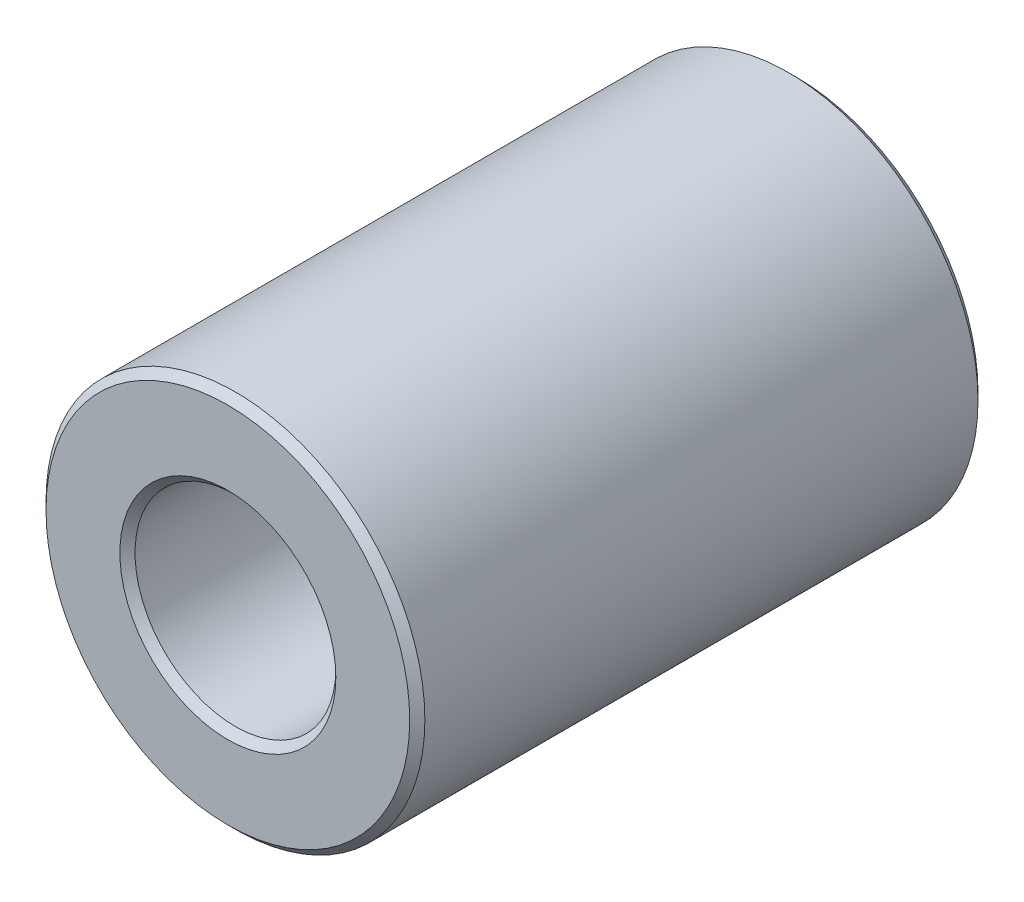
ISO-10303-21;
HEADER;
FILE_DESCRIPTION(('STEP AP214'),'2;1');
FILE_NAME('part.step','',(''),(''),'','','');
FILE_SCHEMA(('AUTOMOTIVE_DESIGN { 1 0 10303 214 1 1 1 1 }'));
ENDSEC;
DATA;
#1=APPLICATION_CONTEXT('core data for automotive mechanical design processes');
#2=APPLICATION_PROTOCOL_DEFINITION('international standard','automotive_design',2000,#1);
#3=PRODUCT_CONTEXT('',#1,'mechanical');
#4=PRODUCT('Part','Part','',(#3));
#5=PRODUCT_RELATED_PRODUCT_CATEGORY('part','',(#4));
#6=PRODUCT_DEFINITION_FORMATION('','',#4);
#7=PRODUCT_DEFINITION_CONTEXT('part definition',#1,'design');
#8=PRODUCT_DEFINITION('design','',#6,#7);
#9=PRODUCT_DEFINITION_SHAPE('','',#8);
#10=(LENGTH_UNIT() NAMED_UNIT(*) SI_UNIT(.MILLI.,.METRE.));
#11=(NAMED_UNIT(*) PLANE_ANGLE_UNIT() SI_UNIT($,.RADIAN.));
#12=(NAMED_UNIT(*) SI_UNIT($,.STERADIAN.) SOLID_ANGLE_UNIT());
#13=UNCERTAINTY_MEASURE_WITH_UNIT(LENGTH_MEASURE(1.E-05),#10,'distance_accuracy_value','');
#14=(GEOMETRIC_REPRESENTATION_CONTEXT(3) GLOBAL_UNCERTAINTY_ASSIGNED_CONTEXT((#13)) GLOBAL_UNIT_ASSIGNED_CONTEXT((#10,
#11,#12)) REPRESENTATION_CONTEXT('',''));
#15=CARTESIAN_POINT('',(0.,0.,0.));
#16=DIRECTION('',(0.,0.,1.));
#17=DIRECTION('',(1.,0.,0.));
#18=AXIS2_PLACEMENT_3D('',#15,#16,#17);
#19=CARTESIAN_POINT('',(0.,0.,7.5));
#20=DIRECTION('',(0.,0.,1.));
#21=DIRECTION('',(1.,0.,0.));
#22=AXIS2_PLACEMENT_3D('',#19,#20,#21);
#23=PLANE('',#22);
#24=CARTESIAN_POINT('',(0.,0.,7.5));
#25=DIRECTION('',(0.,0.,1.));
#26=DIRECTION('',(1.,0.,0.));
#27=AXIS2_PLACEMENT_3D('',#24,#25,#26);
#28=CIRCLE('',#27,2.85);
#29=CARTESIAN_POINT('',(2.85,0.,7.5));
#30=VERTEX_POINT('',#29);
#31=EDGE_CURVE('E10',#30,#30,#28,.F.);
#32=ORIENTED_EDGE('',*,*,#31,.T.);
#33=EDGE_LOOP('',(#32));
#34=FACE_BOUND('',#33,.T.);
#35=CARTESIAN_POINT('',(0.,0.,7.5));
#36=DIRECTION('',(0.,0.,1.));
#37=DIRECTION('',(1.,0.,0.));
#38=AXIS2_PLACEMENT_3D('',#35,#36,#37);
#39=CIRCLE('',#38,4.8);
#40=CARTESIAN_POINT('',(-4.8,0.,7.5));
#41=VERTEX_POINT('',#40);
#42=EDGE_CURVE('E45',#41,#41,#39,.T.);
#43=ORIENTED_EDGE('',*,*,#42,.T.);
#44=EDGE_LOOP('',(#43));
#45=FACE_BOUND('',#44,.T.);
#46=ADVANCED_FACE('F37',(#34,#45),#23,.T.);
#47=CARTESIAN_POINT('',(0.,0.,-7.5));
#48=DIRECTION('',(0.,0.,1.));
#49=DIRECTION('',(1.,0.,0.));
#50=AXIS2_PLACEMENT_3D('',#47,#48,#49);
#51=PLANE('',#50);
#52=CARTESIAN_POINT('',(0.,0.,-7.5));
#53=DIRECTION('',(0.,0.,1.));
#54=DIRECTION('',(1.,0.,0.));
#55=AXIS2_PLACEMENT_3D('',#52,#53,#54);
#56=CIRCLE('',#55,4.8);
#57=CARTESIAN_POINT('',(4.8,0.,-7.5));
#58=VERTEX_POINT('',#57);
#59=EDGE_CURVE('E62',#58,#58,#56,.F.);
#60=ORIENTED_EDGE('',*,*,#59,.T.);
#61=EDGE_LOOP('',(#60));
#62=FACE_BOUND('',#61,.T.);
#63=CARTESIAN_POINT('',(0.,0.,-7.5));
#64=DIRECTION('',(0.,0.,1.));
#65=DIRECTION('',(1.,0.,0.));
#66=AXIS2_PLACEMENT_3D('',#63,#64,#65);
#67=CIRCLE('',#66,2.85);
#68=CARTESIAN_POINT('',(2.85,0.,-7.5));
#69=VERTEX_POINT('',#68);
#70=EDGE_CURVE('E66',#69,#69,#67,.T.);
#71=ORIENTED_EDGE('',*,*,#70,.T.);
#72=EDGE_LOOP('',(#71));
#73=FACE_BOUND('',#72,.T.);
#74=ADVANCED_FACE('F89',(#62,#73),#51,.F.);
#75=CARTESIAN_POINT('',(0.,0.,7.5));
#76=DIRECTION('',(0.,0.,-1.));
#77=DIRECTION('',(-1.,0.,0.));
#78=AXIS2_PLACEMENT_3D('',#75,#76,#77);
#79=CYLINDRICAL_SURFACE('',#78,5.);
#80=CARTESIAN_POINT('',(0.,0.,-7.3));
#81=DIRECTION('',(0.,0.,1.));
#82=DIRECTION('',(1.,0.,0.));
#83=AXIS2_PLACEMENT_3D('',#80,#81,#82);
#84=CIRCLE('',#83,5.);
#85=CARTESIAN_POINT('',(5.,0.,-7.3));
#86=VERTEX_POINT('',#85);
#87=EDGE_CURVE('E70',#86,#86,#84,.T.);
#88=ORIENTED_EDGE('',*,*,#87,.T.);
#89=EDGE_LOOP('',(#88));
#90=FACE_BOUND('',#89,.T.);
#91=CARTESIAN_POINT('',(0.,0.,7.3));
#92=DIRECTION('',(0.,0.,1.));
#93=DIRECTION('',(1.,0.,0.));
#94=AXIS2_PLACEMENT_3D('',#91,#92,#93);
#95=CIRCLE('',#94,5.);
#96=CARTESIAN_POINT('',(-5.,0.,7.3));
#97=VERTEX_POINT('',#96);
#98=EDGE_CURVE('E73',#97,#97,#95,.F.);
#99=ORIENTED_EDGE('',*,*,#98,.T.);
#100=EDGE_LOOP('',(#99));
#101=FACE_BOUND('',#100,.T.);
#102=ADVANCED_FACE('F78',(#90,#101),#79,.T.);
#103=CARTESIAN_POINT('',(0.,0.,7.5));
#104=DIRECTION('',(0.,0.,-1.));
#105=DIRECTION('',(-1.,0.,0.));
#106=AXIS2_PLACEMENT_3D('',#103,#104,#105);
#107=CYLINDRICAL_SURFACE('',#106,2.65);
#108=CARTESIAN_POINT('',(0.,0.,-7.3));
#109=DIRECTION('',(0.,0.,1.));
#110=DIRECTION('',(1.,0.,0.));
#111=AXIS2_PLACEMENT_3D('',#108,#109,#110);
#112=CIRCLE('',#111,2.65);
#113=CARTESIAN_POINT('',(2.65,0.,-7.3));
#114=VERTEX_POINT('',#113);
#115=EDGE_CURVE('E51',#114,#114,#112,.F.);
#116=ORIENTED_EDGE('',*,*,#115,.T.);
#117=EDGE_LOOP('',(#116));
#118=FACE_BOUND('',#117,.T.);
#119=CARTESIAN_POINT('',(0.,0.,7.3));
#120=DIRECTION('',(0.,0.,1.));
#121=DIRECTION('',(1.,0.,0.));
#122=AXIS2_PLACEMENT_3D('',#119,#120,#121);
#123=CIRCLE('',#122,2.65);
#124=CARTESIAN_POINT('',(2.65,0.,7.3));
#125=VERTEX_POINT('',#124);
#126=EDGE_CURVE('E56',#125,#125,#123,.T.);
#127=ORIENTED_EDGE('',*,*,#126,.T.);
#128=EDGE_LOOP('',(#127));
#129=FACE_BOUND('',#128,.T.);
#130=ADVANCED_FACE('F97',(#118,#129),#107,.F.);
#131=CARTESIAN_POINT('',(0.,0.,-7.3));
#132=DIRECTION('',(0.,0.,1.));
#133=DIRECTION('',(1.,0.,0.));
#134=AXIS2_PLACEMENT_3D('',#131,#132,#133);
#135=CONICAL_SURFACE('',#134,5.,0.785398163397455);
#136=ORIENTED_EDGE('',*,*,#59,.F.);
#137=EDGE_LOOP('',(#136));
#138=FACE_BOUND('',#137,.T.);
#139=ORIENTED_EDGE('',*,*,#87,.F.);
#140=EDGE_LOOP('',(#139));
#141=FACE_BOUND('',#140,.T.);
#142=ADVANCED_FACE('F102',(#138,#141),#135,.T.);
#143=CARTESIAN_POINT('',(0.,0.,-7.5));
#144=DIRECTION('',(0.,0.,-1.));
#145=DIRECTION('',(-1.,0.,0.));
#146=AXIS2_PLACEMENT_3D('',#143,#144,#145);
#147=CONICAL_SURFACE('',#146,2.85,0.785398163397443);
#148=ORIENTED_EDGE('',*,*,#115,.F.);
#149=EDGE_LOOP('',(#148));
#150=FACE_BOUND('',#149,.T.);
#151=ORIENTED_EDGE('',*,*,#70,.F.);
#152=EDGE_LOOP('',(#151));
#153=FACE_BOUND('',#152,.T.);
#154=ADVANCED_FACE('F86',(#150,#153),#147,.F.);
#155=CARTESIAN_POINT('',(0.,0.,7.3));
#156=DIRECTION('',(0.,0.,1.));
#157=DIRECTION('',(1.,0.,0.));
#158=AXIS2_PLACEMENT_3D('',#155,#156,#157);
#159=CONICAL_SURFACE('',#158,2.65,0.785398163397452);
#160=ORIENTED_EDGE('',*,*,#31,.F.);
#161=EDGE_LOOP('',(#160));
#162=FACE_BOUND('',#161,.T.);
#163=ORIENTED_EDGE('',*,*,#126,.F.);
#164=EDGE_LOOP('',(#163));
#165=FACE_BOUND('',#164,.T.);
#166=ADVANCED_FACE('F82',(#162,#165),#159,.F.);
#167=CARTESIAN_POINT('',(0.,0.,7.5));
#168=DIRECTION('',(0.,0.,-1.));
#169=DIRECTION('',(-1.,0.,0.));
#170=AXIS2_PLACEMENT_3D('',#167,#168,#169);
#171=CONICAL_SURFACE('',#170,4.8,0.785398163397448);
#172=CARTESIAN_POINT('',(-5.,0.,7.3));
#173=CARTESIAN_POINT('',(-4.99791666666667,0.,7.30208333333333));
#174=CARTESIAN_POINT('',(-4.99583333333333,0.,7.30416666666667));
#175=CARTESIAN_POINT('',(-4.99166666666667,0.,7.30833333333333));
#176=CARTESIAN_POINT('',(-4.98958333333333,0.,7.31041666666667));
#177=CARTESIAN_POINT('',(-4.98541666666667,0.,7.31458333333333));
#178=CARTESIAN_POINT('',(-4.98333333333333,0.,7.31666666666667));
#179=CARTESIAN_POINT('',(-4.97916666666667,0.,7.32083333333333));
#180=CARTESIAN_POINT('',(-4.97708333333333,0.,7.32291666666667));
#181=CARTESIAN_POINT('',(-4.97291666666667,0.,7.32708333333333));
#182=CARTESIAN_POINT('',(-4.97083333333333,0.,7.32916666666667));
#183=CARTESIAN_POINT('',(-4.96666666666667,0.,7.33333333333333));
#184=CARTESIAN_POINT('',(-4.96458333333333,0.,7.33541666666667));
#185=CARTESIAN_POINT('',(-4.96041666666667,0.,7.33958333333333));
#186=CARTESIAN_POINT('',(-4.95833333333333,0.,7.34166666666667));
#187=CARTESIAN_POINT('',(-4.95416666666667,0.,7.34583333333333));
#188=CARTESIAN_POINT('',(-4.95208333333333,0.,7.34791666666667));
#189=CARTESIAN_POINT('',(-4.94791666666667,0.,7.35208333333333));
#190=CARTESIAN_POINT('',(-4.94583333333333,0.,7.35416666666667));
#191=CARTESIAN_POINT('',(-4.94166666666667,0.,7.35833333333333));
#192=CARTESIAN_POINT('',(-4.93958333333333,0.,7.36041666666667));
#193=CARTESIAN_POINT('',(-4.93541666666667,0.,7.36458333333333));
#194=CARTESIAN_POINT('',(-4.93333333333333,0.,7.36666666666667));
#195=CARTESIAN_POINT('',(-4.92916666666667,0.,7.37083333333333));
#196=CARTESIAN_POINT('',(-4.92708333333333,0.,7.37291666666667));
#197=CARTESIAN_POINT('',(-4.92291666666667,0.,7.37708333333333));
#198=CARTESIAN_POINT('',(-4.92083333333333,0.,7.37916666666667));
#199=CARTESIAN_POINT('',(-4.91666666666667,0.,7.38333333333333));
#200=CARTESIAN_POINT('',(-4.91458333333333,0.,7.38541666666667));
#201=CARTESIAN_POINT('',(-4.91041666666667,0.,7.38958333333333));
#202=CARTESIAN_POINT('',(-4.90833333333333,0.,7.39166666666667));
#203=CARTESIAN_POINT('',(-4.90416666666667,0.,7.39583333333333));
#204=CARTESIAN_POINT('',(-4.90208333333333,0.,7.39791666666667));
#205=CARTESIAN_POINT('',(-4.89791666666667,0.,7.40208333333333));
#206=CARTESIAN_POINT('',(-4.89583333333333,0.,7.40416666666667));
#207=CARTESIAN_POINT('',(-4.89166666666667,0.,7.40833333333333));
#208=CARTESIAN_POINT('',(-4.88958333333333,0.,7.41041666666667));
#209=CARTESIAN_POINT('',(-4.88541666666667,0.,7.41458333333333));
#210=CARTESIAN_POINT('',(-4.88333333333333,0.,7.41666666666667));
#211=CARTESIAN_POINT('',(-4.87916666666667,0.,7.42083333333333));
#212=CARTESIAN_POINT('',(-4.87708333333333,0.,7.42291666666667));
#213=CARTESIAN_POINT('',(-4.87291666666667,0.,7.42708333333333));
#214=CARTESIAN_POINT('',(-4.87083333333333,0.,7.42916666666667));
#215=CARTESIAN_POINT('',(-4.86666666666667,0.,7.43333333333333));
#216=CARTESIAN_POINT('',(-4.86458333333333,0.,7.43541666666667));
#217=CARTESIAN_POINT('',(-4.86041666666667,0.,7.43958333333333));
#218=CARTESIAN_POINT('',(-4.85833333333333,0.,7.44166666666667));
#219=CARTESIAN_POINT('',(-4.85416666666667,0.,7.44583333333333));
#220=CARTESIAN_POINT('',(-4.85208333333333,0.,7.44791666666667));
#221=CARTESIAN_POINT('',(-4.84791666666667,0.,7.45208333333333));
#222=CARTESIAN_POINT('',(-4.84583333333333,0.,7.45416666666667));
#223=CARTESIAN_POINT('',(-4.84166666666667,0.,7.45833333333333));
#224=CARTESIAN_POINT('',(-4.83958333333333,0.,7.46041666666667));
#225=CARTESIAN_POINT('',(-4.83541666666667,0.,7.46458333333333));
#226=CARTESIAN_POINT('',(-4.83333333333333,0.,7.46666666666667));
#227=CARTESIAN_POINT('',(-4.82916666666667,0.,7.47083333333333));
#228=CARTESIAN_POINT('',(-4.82708333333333,0.,7.47291666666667));
#229=CARTESIAN_POINT('',(-4.82291666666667,0.,7.47708333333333));
#230=CARTESIAN_POINT('',(-4.82083333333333,0.,7.47916666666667));
#231=CARTESIAN_POINT('',(-4.81666666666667,0.,7.48333333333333));
#232=CARTESIAN_POINT('',(-4.81458333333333,0.,7.48541666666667));
#233=CARTESIAN_POINT('',(-4.81041666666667,0.,7.48958333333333));
#234=CARTESIAN_POINT('',(-4.80833333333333,0.,7.49166666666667));
#235=CARTESIAN_POINT('',(-4.80416666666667,0.,7.49583333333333));
#236=CARTESIAN_POINT('',(-4.80208333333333,0.,7.49791666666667));
#237=CARTESIAN_POINT('',(-4.8,0.,7.5));
#238=B_SPLINE_CURVE_WITH_KNOTS('',3,(#172,#173,#174,#175,#176,#177,#178,#179,#180,#181,#182,
#183,#184,#185,#186,#187,#188,#189,#190,#191,#192,#193,#194,#195,#196,#197,#198,#199,#200,#201,
#202,#203,#204,#205,#206,#207,#208,#209,#210,#211,#212,#213,#214,#215,#216,#217,#218,#219,#220,
#221,#222,#223,#224,#225,#226,#227,#228,#229,#230,#231,#232,#233,#234,#235,#236,#237),
.UNSPECIFIED.,.F.,.F.,(4,2,2,2,2,2,2,2,2,2,2,2,2,2,2,2,2,2,2,2,2,2,2,2,2,2,2,2,2,2,2,2,4),(0.,
0.00883883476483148,0.0176776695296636,0.0265165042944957,0.0353553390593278,0.0441941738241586,
0.0530330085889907,0.0618718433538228,0.0707106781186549,0.0795495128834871,0.0883883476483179,
0.09722718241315,0.106066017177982,0.114904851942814,0.123743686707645,0.132582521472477,
0.141421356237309,0.150260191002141,0.159099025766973,0.167937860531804,0.176776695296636,
0.185615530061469,0.194454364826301,0.203293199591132,0.212132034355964,0.220970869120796,
0.229809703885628,0.23864853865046,0.247487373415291,0.256326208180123,0.265165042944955,
0.274003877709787,0.282842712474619),.UNSPECIFIED.);
#239=EDGE_CURVE('BSEAM39',#97,#41,#238,.T.);
#240=ORIENTED_EDGE('',*,*,#98,.F.);
#241=ORIENTED_EDGE('',*,*,#42,.F.);
#242=ORIENTED_EDGE('',*,*,#239,.T.);
#243=ORIENTED_EDGE('',*,*,#239,.F.);
#244=EDGE_LOOP('',(#240,#242,#241,#243));
#245=FACE_BOUND('',#244,.T.);
#246=ADVANCED_FACE('F39',(#245),#171,.T.);
#247=CLOSED_SHELL('',(#46,#74,#102,#130,#142,#154,#166,#246));
#248=MANIFOLD_SOLID_BREP('B2',#247);
#249=ADVANCED_BREP_SHAPE_REPRESENTATION('',(#18,#248),#14);
#250=SHAPE_DEFINITION_REPRESENTATION(#9,#249);
ENDSEC;
END-ISO-10303-21;
